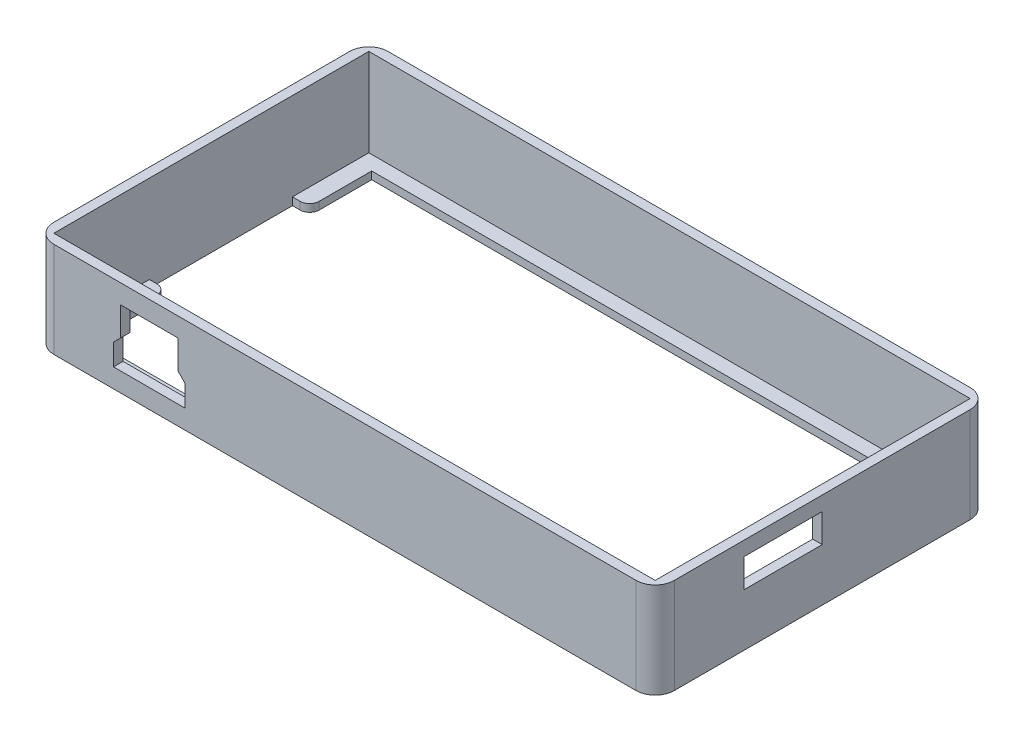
from build123d import *

# Parameters (mm, degrees)
SKETCH_1_W                 = 65
SKETCH_1_H                 = 35
EXTRUDE_1_DEPTH            = 10
SHELL_4_T                  = -1
SHELL_4_THICKNESS_2_FACE_W = 33
SHELL_4_THICKNESS_2_FACE_H = 63
SHELL_4_THICKNESS_2_DEPTH  = 0.2
CUT_EXTRUDE_4_REACH        = 40.243
FILLET_2_R                 = 2
FILLET_3_R                 = 1
CUT_EXTRUDE_5_REACH        = 70.053
SKETCH_11_W                = 8.2
SKETCH_11_H                = 3
CUT_EXTRUDE_6_DEPTH        = 3


with BuildPart() as part:
    # Sketch 1 → Extrude 1 (new body)
    with BuildSketch(Plane(origin=(0, 0, 0), x_dir=(1, 0, 0), z_dir=(0, 1, 0))):
        Rectangle(SKETCH_1_W, SKETCH_1_H)
    extrude(amount=EXTRUDE_1_DEPTH)

    # Shell 4
    shell_4_openings = [part.faces().sort_by_distance(p)[0] for p in [
        (0, 10, 0),
    ]]
    offset(amount=SHELL_4_T, openings=shell_4_openings, kind=Kind.INTERSECTION)

    # Shell 4 thickness 2 face (on inner face of the shell) → Shell 4 thickness 2 (cut)
    with BuildSketch(Plane(origin=(0, 1, 0), x_dir=(0, 0, -1), z_dir=(0, -1, 0))):
        Rectangle(SHELL_4_THICKNESS_2_FACE_W, SHELL_4_THICKNESS_2_FACE_H)
    extrude(amount=SHELL_4_THICKNESS_2_DEPTH, mode=Mode.SUBTRACT)

    # Sketch 3 → Cut-Extrude 4 (cut, up to next)
    with BuildSketch(Plane.XZ, mode=Mode.PRIVATE) as cut_extrude_4_sk1:
        Polygon((-29.7, -15), (30.5, -15), (30.5, 15), (-29.7, 15), (-29.7, 6.5), (-31.5, 6.5), (-31.5, -8.5), (-29.7, -8.5), align=None)
    cut_extrude_4_tool1 = extrude(cut_extrude_4_sk1.sketch, amount=-CUT_EXTRUDE_4_REACH, mode=Mode.PRIVATE) & part.part
    add(cut_extrude_4_tool1.solids().sort_by_distance((-0.056628, 0, -0.01473))[0], mode=Mode.SUBTRACT)

    # Fillet 2
    fillet_2_edges = [part.edges().sort_by_distance(p)[0] for p in [
        (32.5, 5, 17.5),
        (-32.5, 5, 17.5),
        (-32.5, 5, -17.5),
        (32.5, 5, -17.5),
    ]]
    fillet(fillet_2_edges, radius=FILLET_2_R)

    # Fillet 3
    fillet_3_edges = [part.edges().sort_by_distance(p)[0] for p in [
        (-29.7, 0.4, 6.5),
        (-29.7, 0.4, -8.5),
    ]]
    fillet(fillet_3_edges, radius=FILLET_3_R)

    # Sketch 11 → Cut-Extrude 5 (cut, up to next)
    with BuildSketch(Plane(origin=(32.5, 0, 0), x_dir=(0, 0, -1), z_dir=(1, 0, 0)), mode=Mode.PRIVATE) as cut_extrude_5_sk1:
        with Locations((-4.1, 7)):
            Rectangle(SKETCH_11_W, SKETCH_11_H)
    cut_extrude_5_tool1 = extrude(cut_extrude_5_sk1.sketch, amount=-CUT_EXTRUDE_5_REACH, mode=Mode.PRIVATE) & part.part
    add(cut_extrude_5_tool1.solids().sort_by_distance((32.5, 7, 4.1))[0], mode=Mode.SUBTRACT)

    # Sketch 12 → Cut-Extrude 6 (cut)
    with BuildSketch(Plane.XY.offset(17.5)):
        Polygon((-23.5, 5), (-24.25, 4.25), (-24.25, 2), (-23.5, 2), (-17.5, 2), (-16.75, 2), (-16.75, 4.25), (-17.5, 5), (-17.5, 8), (-23.5, 8), align=None)
    extrude(amount=-CUT_EXTRUDE_6_DEPTH, mode=Mode.SUBTRACT)


solid = part.part
